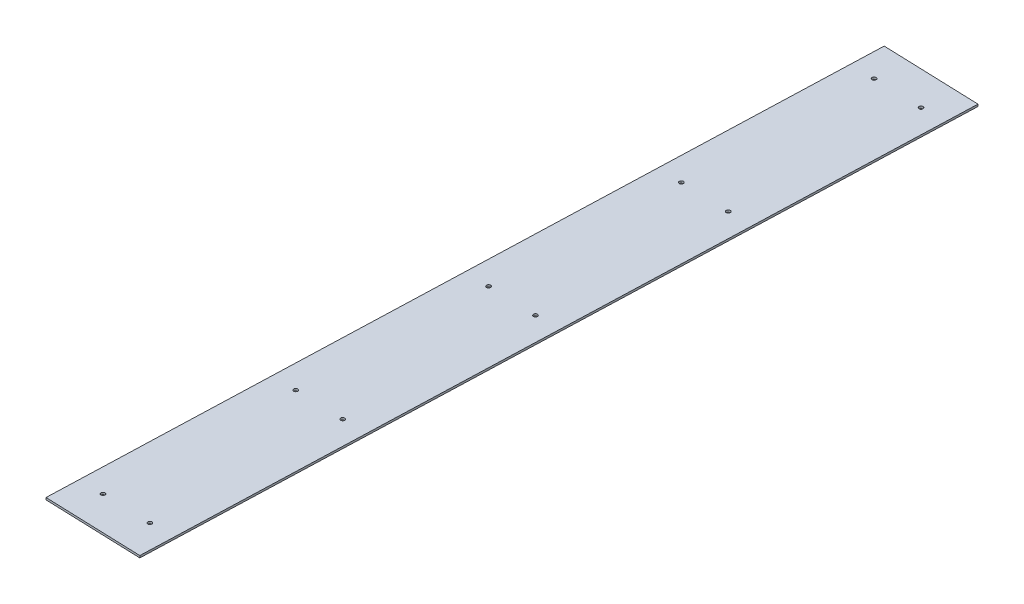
ISO-10303-21;
HEADER;
FILE_DESCRIPTION(('STEP AP214'),'2;1');
FILE_NAME('part.step','',(''),(''),'','','');
FILE_SCHEMA(('AUTOMOTIVE_DESIGN { 1 0 10303 214 1 1 1 1 }'));
ENDSEC;
DATA;
#1=APPLICATION_CONTEXT('core data for automotive mechanical design processes');
#2=APPLICATION_PROTOCOL_DEFINITION('international standard','automotive_design',2000,#1);
#3=PRODUCT_CONTEXT('',#1,'mechanical');
#4=PRODUCT('Part','Part','',(#3));
#5=PRODUCT_RELATED_PRODUCT_CATEGORY('part','',(#4));
#6=PRODUCT_DEFINITION_FORMATION('','',#4);
#7=PRODUCT_DEFINITION_CONTEXT('part definition',#1,'design');
#8=PRODUCT_DEFINITION('design','',#6,#7);
#9=PRODUCT_DEFINITION_SHAPE('','',#8);
#10=(LENGTH_UNIT() NAMED_UNIT(*) SI_UNIT(.MILLI.,.METRE.));
#11=(NAMED_UNIT(*) PLANE_ANGLE_UNIT() SI_UNIT($,.RADIAN.));
#12=(NAMED_UNIT(*) SI_UNIT($,.STERADIAN.) SOLID_ANGLE_UNIT());
#13=UNCERTAINTY_MEASURE_WITH_UNIT(LENGTH_MEASURE(1.E-05),#10,'distance_accuracy_value','');
#14=(GEOMETRIC_REPRESENTATION_CONTEXT(3) GLOBAL_UNCERTAINTY_ASSIGNED_CONTEXT((#13)) GLOBAL_UNIT_ASSIGNED_CONTEXT((#10,
#11,#12)) REPRESENTATION_CONTEXT('',''));
#15=CARTESIAN_POINT('',(0.,0.,0.));
#16=DIRECTION('',(0.,0.,1.));
#17=DIRECTION('',(1.,0.,0.));
#18=AXIS2_PLACEMENT_3D('',#15,#16,#17);
#19=CARTESIAN_POINT('',(768.152910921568,-3.2512,-1179.98685849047));
#20=DIRECTION('',(-0.0347389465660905,0.,0.999396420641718));
#21=DIRECTION('',(0.999396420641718,0.,0.0347389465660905));
#22=AXIS2_PLACEMENT_3D('',#19,#20,#21);
#23=PLANE('',#22);
#24=DIRECTION('',(0.999396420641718,0.,0.0347389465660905));
#25=VECTOR('',#24,1.);
#26=CARTESIAN_POINT('',(768.152910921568,-1.6256,-1179.98685849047));
#27=LINE('',#26,#25);
#28=CARTESIAN_POINT('',(768.152910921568,-1.6256,-1179.98685849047));
#29=VERTEX_POINT('',#28);
#30=CARTESIAN_POINT('',(844.306918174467,-1.6256,-1177.33975076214));
#31=VERTEX_POINT('',#30);
#32=EDGE_CURVE('E102',#29,#31,#27,.T.);
#33=ORIENTED_EDGE('',*,*,#32,.T.);
#34=DIRECTION('',(0.,1.,0.));
#35=VECTOR('',#34,1.);
#36=CARTESIAN_POINT('',(844.306918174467,-3.2512,-1177.33975076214));
#37=LINE('',#36,#35);
#38=CARTESIAN_POINT('',(844.306918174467,-3.2512,-1177.33975076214));
#39=VERTEX_POINT('',#38);
#40=EDGE_CURVE('E11',#39,#31,#37,.T.);
#41=ORIENTED_EDGE('',*,*,#40,.F.);
#42=DIRECTION('',(0.999396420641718,0.,0.0347389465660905));
#43=VECTOR('',#42,1.);
#44=CARTESIAN_POINT('',(768.152910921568,-3.2512,-1179.98685849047));
#45=LINE('',#44,#43);
#46=CARTESIAN_POINT('',(768.152910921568,-3.2512,-1179.98685849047));
#47=VERTEX_POINT('',#46);
#48=EDGE_CURVE('E90',#47,#39,#45,.T.);
#49=ORIENTED_EDGE('',*,*,#48,.F.);
#50=DIRECTION('',(0.,1.,0.));
#51=VECTOR('',#50,1.);
#52=CARTESIAN_POINT('',(768.152910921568,-3.2512,-1179.98685849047));
#53=LINE('',#52,#51);
#54=EDGE_CURVE('E98',#47,#29,#53,.T.);
#55=ORIENTED_EDGE('',*,*,#54,.T.);
#56=EDGE_LOOP('',(#33,#41,#49,#55));
#57=FACE_BOUND('',#56,.T.);
#58=ADVANCED_FACE('F39',(#57),#23,.F.);
#59=CARTESIAN_POINT('',(822.247687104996,-3.2512,-542.723023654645));
#60=DIRECTION('',(-0.999396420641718,0.,-0.0347389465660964));
#61=DIRECTION('',(-0.0347389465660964,0.,0.999396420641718));
#62=AXIS2_PLACEMENT_3D('',#59,#60,#61);
#63=PLANE('',#62);
#64=DIRECTION('',(-0.0347389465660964,0.,0.999396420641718));
#65=VECTOR('',#64,1.);
#66=CARTESIAN_POINT('',(822.247687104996,-1.6256,-542.723023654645));
#67=LINE('',#66,#65);
#68=CARTESIAN_POINT('',(822.247687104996,-1.6256,-542.723023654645));
#69=VERTEX_POINT('',#68);
#70=EDGE_CURVE('E94',#31,#69,#67,.T.);
#71=ORIENTED_EDGE('',*,*,#70,.T.);
#72=DIRECTION('',(0.,1.,0.));
#73=VECTOR('',#72,1.);
#74=CARTESIAN_POINT('',(822.247687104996,-3.2512,-542.723023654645));
#75=LINE('',#74,#73);
#76=CARTESIAN_POINT('',(822.247687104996,-3.2512,-542.723023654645));
#77=VERTEX_POINT('',#76);
#78=EDGE_CURVE('E47',#77,#69,#75,.T.);
#79=ORIENTED_EDGE('',*,*,#78,.F.);
#80=DIRECTION('',(-0.0347389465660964,0.,0.999396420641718));
#81=VECTOR('',#80,1.);
#82=CARTESIAN_POINT('',(822.247687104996,-3.2512,-542.723023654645));
#83=LINE('',#82,#81);
#84=EDGE_CURVE('E85',#39,#77,#83,.T.);
#85=ORIENTED_EDGE('',*,*,#84,.F.);
#86=ORIENTED_EDGE('',*,*,#40,.T.);
#87=EDGE_LOOP('',(#71,#79,#85,#86));
#88=FACE_BOUND('',#87,.T.);
#89=ADVANCED_FACE('F93',(#88),#63,.F.);
#90=CARTESIAN_POINT('',(822.247687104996,-3.2512,-542.723023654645));
#91=DIRECTION('',(0.0347389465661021,0.,-0.999396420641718));
#92=DIRECTION('',(-0.999396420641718,0.,-0.0347389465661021));
#93=AXIS2_PLACEMENT_3D('',#90,#91,#92);
#94=PLANE('',#93);
#95=DIRECTION('',(-0.999396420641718,0.,-0.0347389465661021));
#96=VECTOR('',#95,1.);
#97=CARTESIAN_POINT('',(822.247687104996,-1.6256,-542.723023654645));
#98=LINE('',#97,#96);
#99=CARTESIAN_POINT('',(746.093679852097,-1.6256,-545.370131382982));
#100=VERTEX_POINT('',#99);
#101=EDGE_CURVE('E72',#69,#100,#98,.T.);
#102=ORIENTED_EDGE('',*,*,#101,.T.);
#103=DIRECTION('',(0.,1.,0.));
#104=VECTOR('',#103,1.);
#105=CARTESIAN_POINT('',(746.093679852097,-3.2512,-545.370131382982));
#106=LINE('',#105,#104);
#107=CARTESIAN_POINT('',(746.093679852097,-3.2512,-545.370131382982));
#108=VERTEX_POINT('',#107);
#109=EDGE_CURVE('E95',#108,#100,#106,.T.);
#110=ORIENTED_EDGE('',*,*,#109,.F.);
#111=DIRECTION('',(-0.999396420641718,0.,-0.0347389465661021));
#112=VECTOR('',#111,1.);
#113=CARTESIAN_POINT('',(822.247687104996,-3.2512,-542.723023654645));
#114=LINE('',#113,#112);
#115=EDGE_CURVE('E88',#77,#108,#114,.T.);
#116=ORIENTED_EDGE('',*,*,#115,.F.);
#117=ORIENTED_EDGE('',*,*,#78,.T.);
#118=EDGE_LOOP('',(#102,#110,#116,#117));
#119=FACE_BOUND('',#118,.T.);
#120=ADVANCED_FACE('F96',(#119),#94,.F.);
#121=CARTESIAN_POINT('',(746.093679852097,-3.2512,-545.370131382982));
#122=DIRECTION('',(0.999396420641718,0.,0.0347389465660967));
#123=DIRECTION('',(0.0347389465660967,0.,-0.999396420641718));
#124=AXIS2_PLACEMENT_3D('',#121,#122,#123);
#125=PLANE('',#124);
#126=DIRECTION('',(0.0347389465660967,0.,-0.999396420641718));
#127=VECTOR('',#126,1.);
#128=CARTESIAN_POINT('',(746.093679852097,-1.6256,-545.370131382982));
#129=LINE('',#128,#127);
#130=EDGE_CURVE('E78',#100,#29,#129,.T.);
#131=ORIENTED_EDGE('',*,*,#130,.T.);
#132=ORIENTED_EDGE('',*,*,#54,.F.);
#133=DIRECTION('',(0.0347389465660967,0.,-0.999396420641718));
#134=VECTOR('',#133,1.);
#135=CARTESIAN_POINT('',(746.093679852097,-3.2512,-545.370131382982));
#136=LINE('',#135,#134);
#137=EDGE_CURVE('E55',#108,#47,#136,.T.);
#138=ORIENTED_EDGE('',*,*,#137,.F.);
#139=ORIENTED_EDGE('',*,*,#109,.T.);
#140=EDGE_LOOP('',(#131,#132,#138,#139));
#141=FACE_BOUND('',#140,.T.);
#142=ADVANCED_FACE('F110',(#141),#125,.F.);
#143=CARTESIAN_POINT('',(0.,-3.2512,0.));
#144=DIRECTION('',(0.,1.,0.));
#145=DIRECTION('',(-1.,0.,0.));
#146=AXIS2_PLACEMENT_3D('',#143,#144,#145);
#147=PLANE('',#146);
#148=CARTESIAN_POINT('',(766.0145509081,-3.2512,-570.093023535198));
#149=DIRECTION('',(0.,-1.,0.));
#150=DIRECTION('',(1.,0.,0.));
#151=AXIS2_PLACEMENT_3D('',#148,#149,#150);
#152=CIRCLE('',#151,1.5874999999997);
#153=CARTESIAN_POINT('',(767.6020509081,-3.2512,-570.093023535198));
#154=VERTEX_POINT('',#153);
#155=EDGE_CURVE('E168',#154,#154,#152,.T.);
#156=ORIENTED_EDGE('',*,*,#155,.F.);
#157=EDGE_LOOP('',(#156));
#158=FACE_BOUND('',#157,.T.);
#159=CARTESIAN_POINT('',(771.088174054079,-3.2512,-716.054870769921));
#160=DIRECTION('',(0.,-1.,0.));
#161=DIRECTION('',(1.,0.,0.));
#162=AXIS2_PLACEMENT_3D('',#159,#160,#161);
#163=CIRCLE('',#162,1.58749999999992);
#164=CARTESIAN_POINT('',(772.675674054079,-3.2512,-716.054870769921));
#165=VERTEX_POINT('',#164);
#166=EDGE_CURVE('E165',#165,#165,#163,.T.);
#167=ORIENTED_EDGE('',*,*,#166,.F.);
#168=EDGE_LOOP('',(#167));
#169=FACE_BOUND('',#168,.T.);
#170=CARTESIAN_POINT('',(776.161797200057,-3.2512,-862.016718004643));
#171=DIRECTION('',(0.,-1.,0.));
#172=DIRECTION('',(1.,0.,0.));
#173=AXIS2_PLACEMENT_3D('',#170,#171,#172);
#174=CIRCLE('',#173,1.58749999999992);
#175=CARTESIAN_POINT('',(777.749297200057,-3.2512,-862.016718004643));
#176=VERTEX_POINT('',#175);
#177=EDGE_CURVE('E159',#176,#176,#174,.T.);
#178=ORIENTED_EDGE('',*,*,#177,.F.);
#179=EDGE_LOOP('',(#178));
#180=FACE_BOUND('',#179,.T.);
#181=CARTESIAN_POINT('',(781.235420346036,-3.2512,-1007.97856523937));
#182=DIRECTION('',(0.,-1.,0.));
#183=DIRECTION('',(1.,0.,0.));
#184=AXIS2_PLACEMENT_3D('',#181,#182,#183);
#185=CIRCLE('',#184,1.58749999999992);
#186=CARTESIAN_POINT('',(782.822920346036,-3.2512,-1007.97856523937));
#187=VERTEX_POINT('',#186);
#188=EDGE_CURVE('E153',#187,#187,#185,.T.);
#189=ORIENTED_EDGE('',*,*,#188,.F.);
#190=EDGE_LOOP('',(#189));
#191=FACE_BOUND('',#190,.T.);
#192=CARTESIAN_POINT('',(786.309043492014,-3.2512,-1153.94041247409));
#193=DIRECTION('',(0.,-1.,0.));
#194=DIRECTION('',(1.,0.,0.));
#195=AXIS2_PLACEMENT_3D('',#192,#193,#194);
#196=CIRCLE('',#195,1.58749999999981);
#197=CARTESIAN_POINT('',(787.896543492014,-3.2512,-1153.94041247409));
#198=VERTEX_POINT('',#197);
#199=EDGE_CURVE('E147',#198,#198,#196,.T.);
#200=ORIENTED_EDGE('',*,*,#199,.F.);
#201=EDGE_LOOP('',(#200));
#202=FACE_BOUND('',#201,.T.);
#203=CARTESIAN_POINT('',(824.386047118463,-3.2512,-1152.61685860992));
#204=DIRECTION('',(0.,-1.,0.));
#205=DIRECTION('',(-1.,0.,0.));
#206=AXIS2_PLACEMENT_3D('',#203,#204,#205);
#207=CIRCLE('',#206,1.5874999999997);
#208=CARTESIAN_POINT('',(822.798547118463,-3.2512,-1152.61685860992));
#209=VERTEX_POINT('',#208);
#210=EDGE_CURVE('E141',#209,#209,#207,.T.);
#211=ORIENTED_EDGE('',*,*,#210,.F.);
#212=EDGE_LOOP('',(#211));
#213=FACE_BOUND('',#212,.T.);
#214=CARTESIAN_POINT('',(819.312423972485,-3.2512,-1006.6550113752));
#215=DIRECTION('',(0.,-1.,0.));
#216=DIRECTION('',(-1.,0.,0.));
#217=AXIS2_PLACEMENT_3D('',#214,#215,#216);
#218=CIRCLE('',#217,1.58749999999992);
#219=CARTESIAN_POINT('',(817.724923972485,-3.2512,-1006.6550113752));
#220=VERTEX_POINT('',#219);
#221=EDGE_CURVE('E135',#220,#220,#218,.T.);
#222=ORIENTED_EDGE('',*,*,#221,.F.);
#223=EDGE_LOOP('',(#222));
#224=FACE_BOUND('',#223,.T.);
#225=CARTESIAN_POINT('',(814.238800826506,-3.2512,-860.693164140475));
#226=DIRECTION('',(0.,-1.,0.));
#227=DIRECTION('',(-1.,0.,0.));
#228=AXIS2_PLACEMENT_3D('',#225,#226,#227);
#229=CIRCLE('',#228,1.58749999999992);
#230=CARTESIAN_POINT('',(812.651300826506,-3.2512,-860.693164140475));
#231=VERTEX_POINT('',#230);
#232=EDGE_CURVE('E129',#231,#231,#229,.T.);
#233=ORIENTED_EDGE('',*,*,#232,.F.);
#234=EDGE_LOOP('',(#233));
#235=FACE_BOUND('',#234,.T.);
#236=CARTESIAN_POINT('',(809.165177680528,-3.2512,-714.731316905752));
#237=DIRECTION('',(0.,-1.,0.));
#238=DIRECTION('',(-1.,0.,0.));
#239=AXIS2_PLACEMENT_3D('',#236,#237,#238);
#240=CIRCLE('',#239,1.58749999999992);
#241=CARTESIAN_POINT('',(807.577677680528,-3.2512,-714.731316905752));
#242=VERTEX_POINT('',#241);
#243=EDGE_CURVE('E123',#242,#242,#240,.T.);
#244=ORIENTED_EDGE('',*,*,#243,.F.);
#245=EDGE_LOOP('',(#244));
#246=FACE_BOUND('',#245,.T.);
#247=CARTESIAN_POINT('',(804.091554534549,-3.2512,-568.769469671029));
#248=DIRECTION('',(0.,-1.,0.));
#249=DIRECTION('',(-1.,0.,0.));
#250=AXIS2_PLACEMENT_3D('',#247,#248,#249);
#251=CIRCLE('',#250,1.58749999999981);
#252=CARTESIAN_POINT('',(802.50405453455,-3.2512,-568.769469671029));
#253=VERTEX_POINT('',#252);
#254=EDGE_CURVE('E116',#253,#253,#251,.T.);
#255=ORIENTED_EDGE('',*,*,#254,.F.);
#256=EDGE_LOOP('',(#255));
#257=FACE_BOUND('',#256,.T.);
#258=ORIENTED_EDGE('',*,*,#48,.T.);
#259=ORIENTED_EDGE('',*,*,#84,.T.);
#260=ORIENTED_EDGE('',*,*,#115,.T.);
#261=ORIENTED_EDGE('',*,*,#137,.T.);
#262=EDGE_LOOP('',(#258,#259,#260,#261));
#263=FACE_BOUND('',#262,.T.);
#264=ADVANCED_FACE('F86',(#158,#169,#180,#191,#202,#213,#224,#235,#246,#257,#263),#147,.F.);
#265=CARTESIAN_POINT('',(0.,-1.6256,0.));
#266=DIRECTION('',(0.,1.,0.));
#267=DIRECTION('',(-1.,0.,0.));
#268=AXIS2_PLACEMENT_3D('',#265,#266,#267);
#269=PLANE('',#268);
#270=CARTESIAN_POINT('',(766.0145509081,-1.6256,-570.093023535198));
#271=DIRECTION('',(0.,1.,0.));
#272=DIRECTION('',(-1.,0.,0.));
#273=AXIS2_PLACEMENT_3D('',#270,#271,#272);
#274=CIRCLE('',#273,1.5874999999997);
#275=CARTESIAN_POINT('',(764.4270509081,-1.6256,-570.093023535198));
#276=VERTEX_POINT('',#275);
#277=EDGE_CURVE('E105',#276,#276,#274,.F.);
#278=ORIENTED_EDGE('',*,*,#277,.T.);
#279=EDGE_LOOP('',(#278));
#280=FACE_BOUND('',#279,.T.);
#281=CARTESIAN_POINT('',(771.088174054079,-1.6256,-716.054870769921));
#282=DIRECTION('',(0.,1.,0.));
#283=DIRECTION('',(-1.,0.,0.));
#284=AXIS2_PLACEMENT_3D('',#281,#282,#283);
#285=CIRCLE('',#284,1.58749999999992);
#286=CARTESIAN_POINT('',(769.500674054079,-1.6256,-716.054870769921));
#287=VERTEX_POINT('',#286);
#288=EDGE_CURVE('E162',#287,#287,#285,.F.);
#289=ORIENTED_EDGE('',*,*,#288,.T.);
#290=EDGE_LOOP('',(#289));
#291=FACE_BOUND('',#290,.T.);
#292=CARTESIAN_POINT('',(776.161797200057,-1.6256,-862.016718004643));
#293=DIRECTION('',(0.,1.,0.));
#294=DIRECTION('',(-1.,0.,0.));
#295=AXIS2_PLACEMENT_3D('',#292,#293,#294);
#296=CIRCLE('',#295,1.58749999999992);
#297=CARTESIAN_POINT('',(774.574297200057,-1.6256,-862.016718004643));
#298=VERTEX_POINT('',#297);
#299=EDGE_CURVE('E156',#298,#298,#296,.F.);
#300=ORIENTED_EDGE('',*,*,#299,.T.);
#301=EDGE_LOOP('',(#300));
#302=FACE_BOUND('',#301,.T.);
#303=CARTESIAN_POINT('',(781.235420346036,-1.6256,-1007.97856523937));
#304=DIRECTION('',(0.,1.,0.));
#305=DIRECTION('',(-1.,0.,0.));
#306=AXIS2_PLACEMENT_3D('',#303,#304,#305);
#307=CIRCLE('',#306,1.58749999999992);
#308=CARTESIAN_POINT('',(779.647920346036,-1.6256,-1007.97856523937));
#309=VERTEX_POINT('',#308);
#310=EDGE_CURVE('E150',#309,#309,#307,.F.);
#311=ORIENTED_EDGE('',*,*,#310,.T.);
#312=EDGE_LOOP('',(#311));
#313=FACE_BOUND('',#312,.T.);
#314=CARTESIAN_POINT('',(786.309043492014,-1.6256,-1153.94041247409));
#315=DIRECTION('',(0.,1.,0.));
#316=DIRECTION('',(-1.,0.,0.));
#317=AXIS2_PLACEMENT_3D('',#314,#315,#316);
#318=CIRCLE('',#317,1.58749999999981);
#319=CARTESIAN_POINT('',(784.721543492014,-1.6256,-1153.94041247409));
#320=VERTEX_POINT('',#319);
#321=EDGE_CURVE('E144',#320,#320,#318,.F.);
#322=ORIENTED_EDGE('',*,*,#321,.T.);
#323=EDGE_LOOP('',(#322));
#324=FACE_BOUND('',#323,.T.);
#325=CARTESIAN_POINT('',(824.386047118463,-1.6256,-1152.61685860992));
#326=DIRECTION('',(0.,1.,0.));
#327=DIRECTION('',(-1.,0.,0.));
#328=AXIS2_PLACEMENT_3D('',#325,#326,#327);
#329=CIRCLE('',#328,1.5874999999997);
#330=CARTESIAN_POINT('',(822.798547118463,-1.6256,-1152.61685860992));
#331=VERTEX_POINT('',#330);
#332=EDGE_CURVE('E138',#331,#331,#329,.F.);
#333=ORIENTED_EDGE('',*,*,#332,.T.);
#334=EDGE_LOOP('',(#333));
#335=FACE_BOUND('',#334,.T.);
#336=CARTESIAN_POINT('',(819.312423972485,-1.6256,-1006.6550113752));
#337=DIRECTION('',(0.,1.,0.));
#338=DIRECTION('',(-1.,0.,0.));
#339=AXIS2_PLACEMENT_3D('',#336,#337,#338);
#340=CIRCLE('',#339,1.58749999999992);
#341=CARTESIAN_POINT('',(817.724923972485,-1.6256,-1006.6550113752));
#342=VERTEX_POINT('',#341);
#343=EDGE_CURVE('E132',#342,#342,#340,.F.);
#344=ORIENTED_EDGE('',*,*,#343,.T.);
#345=EDGE_LOOP('',(#344));
#346=FACE_BOUND('',#345,.T.);
#347=CARTESIAN_POINT('',(814.238800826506,-1.6256,-860.693164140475));
#348=DIRECTION('',(0.,1.,0.));
#349=DIRECTION('',(-1.,0.,0.));
#350=AXIS2_PLACEMENT_3D('',#347,#348,#349);
#351=CIRCLE('',#350,1.58749999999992);
#352=CARTESIAN_POINT('',(812.651300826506,-1.6256,-860.693164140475));
#353=VERTEX_POINT('',#352);
#354=EDGE_CURVE('E126',#353,#353,#351,.F.);
#355=ORIENTED_EDGE('',*,*,#354,.T.);
#356=EDGE_LOOP('',(#355));
#357=FACE_BOUND('',#356,.T.);
#358=CARTESIAN_POINT('',(809.165177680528,-1.6256,-714.731316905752));
#359=DIRECTION('',(0.,1.,0.));
#360=DIRECTION('',(-1.,0.,0.));
#361=AXIS2_PLACEMENT_3D('',#358,#359,#360);
#362=CIRCLE('',#361,1.58749999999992);
#363=CARTESIAN_POINT('',(807.577677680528,-1.6256,-714.731316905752));
#364=VERTEX_POINT('',#363);
#365=EDGE_CURVE('E119',#364,#364,#362,.F.);
#366=ORIENTED_EDGE('',*,*,#365,.T.);
#367=EDGE_LOOP('',(#366));
#368=FACE_BOUND('',#367,.T.);
#369=CARTESIAN_POINT('',(804.091554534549,-1.6256,-568.769469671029));
#370=DIRECTION('',(0.,1.,0.));
#371=DIRECTION('',(-1.,0.,0.));
#372=AXIS2_PLACEMENT_3D('',#369,#370,#371);
#373=CIRCLE('',#372,1.58749999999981);
#374=CARTESIAN_POINT('',(802.50405453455,-1.6256,-568.769469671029));
#375=VERTEX_POINT('',#374);
#376=EDGE_CURVE('E120',#375,#375,#373,.F.);
#377=ORIENTED_EDGE('',*,*,#376,.T.);
#378=EDGE_LOOP('',(#377));
#379=FACE_BOUND('',#378,.T.);
#380=ORIENTED_EDGE('',*,*,#32,.F.);
#381=ORIENTED_EDGE('',*,*,#130,.F.);
#382=ORIENTED_EDGE('',*,*,#101,.F.);
#383=ORIENTED_EDGE('',*,*,#70,.F.);
#384=EDGE_LOOP('',(#380,#381,#382,#383));
#385=FACE_BOUND('',#384,.T.);
#386=ADVANCED_FACE('F113',(#280,#291,#302,#313,#324,#335,#346,#357,#368,#379,#385),#269,.T.);
#387=CARTESIAN_POINT('',(804.091554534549,2.86452806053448,-568.769469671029));
#388=DIRECTION('',(0.,-1.,0.));
#389=DIRECTION('',(1.,0.,0.));
#390=AXIS2_PLACEMENT_3D('',#387,#388,#389);
#391=CYLINDRICAL_SURFACE('',#390,1.58749999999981);
#392=ORIENTED_EDGE('',*,*,#254,.T.);
#393=EDGE_LOOP('',(#392));
#394=FACE_BOUND('',#393,.T.);
#395=ORIENTED_EDGE('',*,*,#376,.F.);
#396=EDGE_LOOP('',(#395));
#397=FACE_BOUND('',#396,.T.);
#398=ADVANCED_FACE('F200',(#394,#397),#391,.F.);
#399=CARTESIAN_POINT('',(809.165177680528,2.86452806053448,-714.731316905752));
#400=DIRECTION('',(0.,-1.,0.));
#401=DIRECTION('',(1.,0.,0.));
#402=AXIS2_PLACEMENT_3D('',#399,#400,#401);
#403=CYLINDRICAL_SURFACE('',#402,1.58749999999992);
#404=ORIENTED_EDGE('',*,*,#243,.T.);
#405=EDGE_LOOP('',(#404));
#406=FACE_BOUND('',#405,.T.);
#407=ORIENTED_EDGE('',*,*,#365,.F.);
#408=EDGE_LOOP('',(#407));
#409=FACE_BOUND('',#408,.T.);
#410=ADVANCED_FACE('F203',(#406,#409),#403,.F.);
#411=CARTESIAN_POINT('',(814.238800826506,2.86452806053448,-860.693164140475));
#412=DIRECTION('',(0.,-1.,0.));
#413=DIRECTION('',(1.,0.,0.));
#414=AXIS2_PLACEMENT_3D('',#411,#412,#413);
#415=CYLINDRICAL_SURFACE('',#414,1.58749999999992);
#416=ORIENTED_EDGE('',*,*,#232,.T.);
#417=EDGE_LOOP('',(#416));
#418=FACE_BOUND('',#417,.T.);
#419=ORIENTED_EDGE('',*,*,#354,.F.);
#420=EDGE_LOOP('',(#419));
#421=FACE_BOUND('',#420,.T.);
#422=ADVANCED_FACE('F252',(#418,#421),#415,.F.);
#423=CARTESIAN_POINT('',(819.312423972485,2.86452806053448,-1006.6550113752));
#424=DIRECTION('',(0.,-1.,0.));
#425=DIRECTION('',(1.,0.,0.));
#426=AXIS2_PLACEMENT_3D('',#423,#424,#425);
#427=CYLINDRICAL_SURFACE('',#426,1.58749999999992);
#428=ORIENTED_EDGE('',*,*,#221,.T.);
#429=EDGE_LOOP('',(#428));
#430=FACE_BOUND('',#429,.T.);
#431=ORIENTED_EDGE('',*,*,#343,.F.);
#432=EDGE_LOOP('',(#431));
#433=FACE_BOUND('',#432,.T.);
#434=ADVANCED_FACE('F262',(#430,#433),#427,.F.);
#435=CARTESIAN_POINT('',(824.386047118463,2.86452806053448,-1152.61685860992));
#436=DIRECTION('',(0.,-1.,0.));
#437=DIRECTION('',(1.,0.,0.));
#438=AXIS2_PLACEMENT_3D('',#435,#436,#437);
#439=CYLINDRICAL_SURFACE('',#438,1.5874999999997);
#440=ORIENTED_EDGE('',*,*,#210,.T.);
#441=EDGE_LOOP('',(#440));
#442=FACE_BOUND('',#441,.T.);
#443=ORIENTED_EDGE('',*,*,#332,.F.);
#444=EDGE_LOOP('',(#443));
#445=FACE_BOUND('',#444,.T.);
#446=ADVANCED_FACE('F272',(#442,#445),#439,.F.);
#447=CARTESIAN_POINT('',(786.309043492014,2.86452806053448,-1153.94041247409));
#448=DIRECTION('',(0.,-1.,0.));
#449=DIRECTION('',(1.,0.,0.));
#450=AXIS2_PLACEMENT_3D('',#447,#448,#449);
#451=CYLINDRICAL_SURFACE('',#450,1.58749999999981);
#452=ORIENTED_EDGE('',*,*,#199,.T.);
#453=EDGE_LOOP('',(#452));
#454=FACE_BOUND('',#453,.T.);
#455=ORIENTED_EDGE('',*,*,#321,.F.);
#456=EDGE_LOOP('',(#455));
#457=FACE_BOUND('',#456,.T.);
#458=ADVANCED_FACE('F282',(#454,#457),#451,.F.);
#459=CARTESIAN_POINT('',(781.235420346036,2.86452806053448,-1007.97856523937));
#460=DIRECTION('',(0.,-1.,0.));
#461=DIRECTION('',(1.,0.,0.));
#462=AXIS2_PLACEMENT_3D('',#459,#460,#461);
#463=CYLINDRICAL_SURFACE('',#462,1.58749999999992);
#464=ORIENTED_EDGE('',*,*,#188,.T.);
#465=EDGE_LOOP('',(#464));
#466=FACE_BOUND('',#465,.T.);
#467=ORIENTED_EDGE('',*,*,#310,.F.);
#468=EDGE_LOOP('',(#467));
#469=FACE_BOUND('',#468,.T.);
#470=ADVANCED_FACE('F292',(#466,#469),#463,.F.);
#471=CARTESIAN_POINT('',(776.161797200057,2.86452806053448,-862.016718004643));
#472=DIRECTION('',(0.,-1.,0.));
#473=DIRECTION('',(1.,0.,0.));
#474=AXIS2_PLACEMENT_3D('',#471,#472,#473);
#475=CYLINDRICAL_SURFACE('',#474,1.58749999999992);
#476=ORIENTED_EDGE('',*,*,#177,.T.);
#477=EDGE_LOOP('',(#476));
#478=FACE_BOUND('',#477,.T.);
#479=ORIENTED_EDGE('',*,*,#299,.F.);
#480=EDGE_LOOP('',(#479));
#481=FACE_BOUND('',#480,.T.);
#482=ADVANCED_FACE('F302',(#478,#481),#475,.F.);
#483=CARTESIAN_POINT('',(771.088174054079,2.86452806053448,-716.054870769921));
#484=DIRECTION('',(0.,-1.,0.));
#485=DIRECTION('',(1.,0.,0.));
#486=AXIS2_PLACEMENT_3D('',#483,#484,#485);
#487=CYLINDRICAL_SURFACE('',#486,1.58749999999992);
#488=ORIENTED_EDGE('',*,*,#166,.T.);
#489=EDGE_LOOP('',(#488));
#490=FACE_BOUND('',#489,.T.);
#491=ORIENTED_EDGE('',*,*,#288,.F.);
#492=EDGE_LOOP('',(#491));
#493=FACE_BOUND('',#492,.T.);
#494=ADVANCED_FACE('F312',(#490,#493),#487,.F.);
#495=CARTESIAN_POINT('',(766.0145509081,2.86452806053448,-570.093023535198));
#496=DIRECTION('',(0.,-1.,0.));
#497=DIRECTION('',(1.,0.,0.));
#498=AXIS2_PLACEMENT_3D('',#495,#496,#497);
#499=CYLINDRICAL_SURFACE('',#498,1.5874999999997);
#500=ORIENTED_EDGE('',*,*,#155,.T.);
#501=EDGE_LOOP('',(#500));
#502=FACE_BOUND('',#501,.T.);
#503=ORIENTED_EDGE('',*,*,#277,.F.);
#504=EDGE_LOOP('',(#503));
#505=FACE_BOUND('',#504,.T.);
#506=ADVANCED_FACE('F176',(#502,#505),#499,.F.);
#507=CLOSED_SHELL('',(#58,#89,#120,#142,#264,#386,#398,#410,#422,#434,#446,#458,#470,#482,#494,#506));
#508=MANIFOLD_SOLID_BREP('B2',#507);
#509=ADVANCED_BREP_SHAPE_REPRESENTATION('',(#18,#508),#14);
#510=SHAPE_DEFINITION_REPRESENTATION(#9,#509);
ENDSEC;
END-ISO-10303-21;
